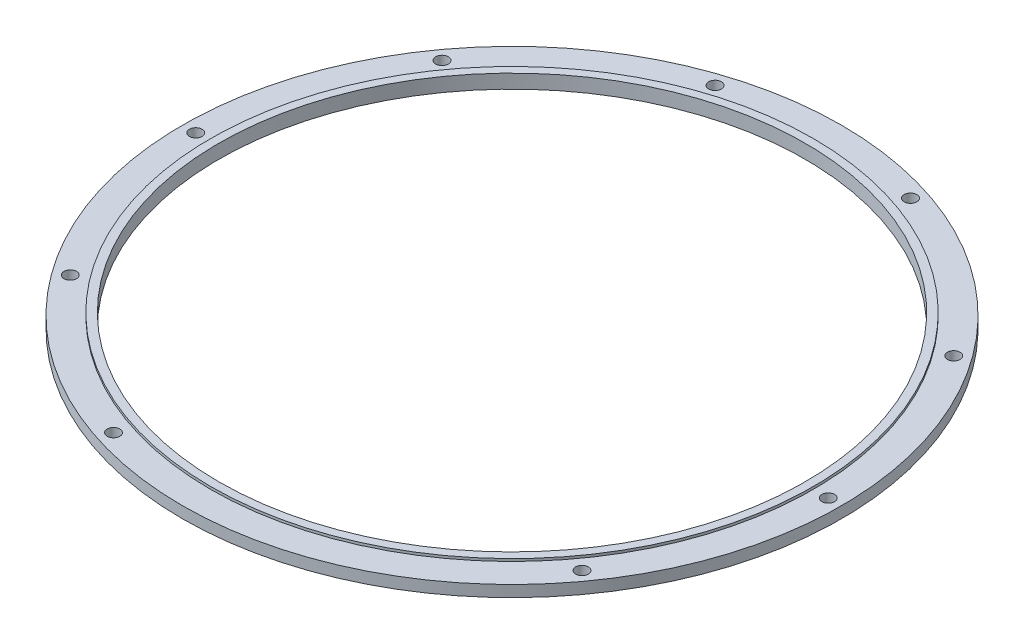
ISO-10303-21;
HEADER;
FILE_DESCRIPTION(('STEP AP214'),'2;1');
FILE_NAME('part.step','',(''),(''),'','','');
FILE_SCHEMA(('AUTOMOTIVE_DESIGN { 1 0 10303 214 1 1 1 1 }'));
ENDSEC;
DATA;
#1=APPLICATION_CONTEXT('core data for automotive mechanical design processes');
#2=APPLICATION_PROTOCOL_DEFINITION('international standard','automotive_design',2000,#1);
#3=PRODUCT_CONTEXT('',#1,'mechanical');
#4=PRODUCT('Part','Part','',(#3));
#5=PRODUCT_RELATED_PRODUCT_CATEGORY('part','',(#4));
#6=PRODUCT_DEFINITION_FORMATION('','',#4);
#7=PRODUCT_DEFINITION_CONTEXT('part definition',#1,'design');
#8=PRODUCT_DEFINITION('design','',#6,#7);
#9=PRODUCT_DEFINITION_SHAPE('','',#8);
#10=(LENGTH_UNIT() NAMED_UNIT(*) SI_UNIT(.MILLI.,.METRE.));
#11=(NAMED_UNIT(*) PLANE_ANGLE_UNIT() SI_UNIT($,.RADIAN.));
#12=(NAMED_UNIT(*) SI_UNIT($,.STERADIAN.) SOLID_ANGLE_UNIT());
#13=UNCERTAINTY_MEASURE_WITH_UNIT(LENGTH_MEASURE(1.E-05),#10,'distance_accuracy_value','');
#14=(GEOMETRIC_REPRESENTATION_CONTEXT(3) GLOBAL_UNCERTAINTY_ASSIGNED_CONTEXT((#13)) GLOBAL_UNIT_ASSIGNED_CONTEXT((#10,
#11,#12)) REPRESENTATION_CONTEXT('',''));
#15=CARTESIAN_POINT('',(0.,0.,0.));
#16=DIRECTION('',(0.,0.,1.));
#17=DIRECTION('',(1.,0.,0.));
#18=AXIS2_PLACEMENT_3D('',#15,#16,#17);
#19=CARTESIAN_POINT('',(0.,0.,0.));
#20=DIRECTION('',(0.,1.,0.));
#21=DIRECTION('',(0.,0.,1.));
#22=AXIS2_PLACEMENT_3D('',#19,#20,#21);
#23=CYLINDRICAL_SURFACE('',#22,84.858);
#24=CARTESIAN_POINT('',(-1.52655665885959E-13,-19.700999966,0.));
#25=DIRECTION('',(0.,1.,0.));
#26=DIRECTION('',(0.,0.,1.));
#27=AXIS2_PLACEMENT_3D('',#24,#25,#26);
#28=CIRCLE('',#27,84.858);
#29=CARTESIAN_POINT('',(-1.52655665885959E-13,-19.700999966,84.858));
#30=VERTEX_POINT('',#29);
#31=EDGE_CURVE('E10',#30,#30,#28,.T.);
#32=ORIENTED_EDGE('',*,*,#31,.T.);
#33=EDGE_LOOP('',(#32));
#34=FACE_BOUND('',#33,.T.);
#35=CARTESIAN_POINT('',(0.,-16.771999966,0.));
#36=DIRECTION('',(0.,1.,0.));
#37=DIRECTION('',(0.,0.,1.));
#38=AXIS2_PLACEMENT_3D('',#35,#36,#37);
#39=CIRCLE('',#38,84.858);
#40=CARTESIAN_POINT('',(0.,-16.771999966,84.858));
#41=VERTEX_POINT('',#40);
#42=EDGE_CURVE('E74',#41,#41,#39,.T.);
#43=ORIENTED_EDGE('',*,*,#42,.F.);
#44=EDGE_LOOP('',(#43));
#45=FACE_BOUND('',#44,.T.);
#46=ADVANCED_FACE('F34',(#34,#45),#23,.T.);
#47=CARTESIAN_POINT('',(-25.1629448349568,-19.7009999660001,-77.4435810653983));
#48=DIRECTION('',(0.,-1.,0.));
#49=DIRECTION('',(0.,0.,-1.));
#50=AXIS2_PLACEMENT_3D('',#47,#48,#49);
#51=CYLINDRICAL_SURFACE('',#50,1.63195);
#52=CARTESIAN_POINT('',(-25.1629448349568,-19.7009999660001,-77.4435810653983));
#53=DIRECTION('',(0.,-1.,0.));
#54=DIRECTION('',(0.,0.,-1.));
#55=AXIS2_PLACEMENT_3D('',#52,#53,#54);
#56=CIRCLE('',#55,1.63195);
#57=CARTESIAN_POINT('',(-25.1629448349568,-19.7009999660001,-79.0755310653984));
#58=VERTEX_POINT('',#57);
#59=EDGE_CURVE('E45',#58,#58,#56,.T.);
#60=ORIENTED_EDGE('',*,*,#59,.T.);
#61=EDGE_LOOP('',(#60));
#62=FACE_BOUND('',#61,.T.);
#63=CARTESIAN_POINT('',(-25.1629448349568,-16.7719999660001,-77.4435810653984));
#64=DIRECTION('',(0.,1.,0.));
#65=DIRECTION('',(0.,0.,1.));
#66=AXIS2_PLACEMENT_3D('',#63,#64,#65);
#67=CIRCLE('',#66,1.63195);
#68=CARTESIAN_POINT('',(-25.1629448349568,-16.7719999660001,-75.8116310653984));
#69=VERTEX_POINT('',#68);
#70=EDGE_CURVE('E77',#69,#69,#67,.F.);
#71=ORIENTED_EDGE('',*,*,#70,.F.);
#72=EDGE_LOOP('',(#71));
#73=FACE_BOUND('',#72,.T.);
#74=ADVANCED_FACE('F126',(#62,#73),#51,.F.);
#75=CARTESIAN_POINT('',(25.1629448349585,-19.7009999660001,-77.4435810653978));
#76=DIRECTION('',(0.,-1.,0.));
#77=DIRECTION('',(0.,0.,-1.));
#78=AXIS2_PLACEMENT_3D('',#75,#76,#77);
#79=CYLINDRICAL_SURFACE('',#78,1.63195);
#80=CARTESIAN_POINT('',(25.1629448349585,-19.7009999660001,-77.4435810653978));
#81=DIRECTION('',(0.,-1.,0.));
#82=DIRECTION('',(0.,0.,-1.));
#83=AXIS2_PLACEMENT_3D('',#80,#81,#82);
#84=CIRCLE('',#83,1.63195);
#85=CARTESIAN_POINT('',(25.1629448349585,-19.7009999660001,-79.0755310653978));
#86=VERTEX_POINT('',#85);
#87=EDGE_CURVE('E50',#86,#86,#84,.T.);
#88=ORIENTED_EDGE('',*,*,#87,.T.);
#89=EDGE_LOOP('',(#88));
#90=FACE_BOUND('',#89,.T.);
#91=CARTESIAN_POINT('',(25.1629448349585,-16.7719999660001,-77.4435810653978));
#92=DIRECTION('',(0.,1.,0.));
#93=DIRECTION('',(0.,0.,1.));
#94=AXIS2_PLACEMENT_3D('',#91,#92,#93);
#95=CIRCLE('',#94,1.63195);
#96=CARTESIAN_POINT('',(25.1629448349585,-16.7719999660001,-75.8116310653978));
#97=VERTEX_POINT('',#96);
#98=EDGE_CURVE('E80',#97,#97,#95,.F.);
#99=ORIENTED_EDGE('',*,*,#98,.F.);
#100=EDGE_LOOP('',(#99));
#101=FACE_BOUND('',#100,.T.);
#102=ADVANCED_FACE('F130',(#90,#101),#79,.F.);
#103=CARTESIAN_POINT('',(65.8774448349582,-19.700999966,-47.862765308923));
#104=DIRECTION('',(0.,-1.,0.));
#105=DIRECTION('',(0.,0.,-1.));
#106=AXIS2_PLACEMENT_3D('',#103,#104,#105);
#107=CYLINDRICAL_SURFACE('',#106,1.63194999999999);
#108=CARTESIAN_POINT('',(65.8774448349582,-19.700999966,-47.862765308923));
#109=DIRECTION('',(0.,-1.,0.));
#110=DIRECTION('',(0.,0.,-1.));
#111=AXIS2_PLACEMENT_3D('',#108,#109,#110);
#112=CIRCLE('',#111,1.63194999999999);
#113=CARTESIAN_POINT('',(65.8774448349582,-19.700999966,-49.494715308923));
#114=VERTEX_POINT('',#113);
#115=EDGE_CURVE('E53',#114,#114,#112,.T.);
#116=ORIENTED_EDGE('',*,*,#115,.T.);
#117=EDGE_LOOP('',(#116));
#118=FACE_BOUND('',#117,.T.);
#119=CARTESIAN_POINT('',(65.8774448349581,-16.771999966,-47.862765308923));
#120=DIRECTION('',(0.,1.,0.));
#121=DIRECTION('',(0.,0.,1.));
#122=AXIS2_PLACEMENT_3D('',#119,#120,#121);
#123=CIRCLE('',#122,1.63194999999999);
#124=CARTESIAN_POINT('',(65.8774448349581,-16.771999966,-46.230815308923));
#125=VERTEX_POINT('',#124);
#126=EDGE_CURVE('E83',#125,#125,#123,.F.);
#127=ORIENTED_EDGE('',*,*,#126,.F.);
#128=EDGE_LOOP('',(#127));
#129=FACE_BOUND('',#128,.T.);
#130=ADVANCED_FACE('F169',(#118,#129),#107,.F.);
#131=CARTESIAN_POINT('',(81.429,-19.700999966,1.13797860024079E-12));
#132=DIRECTION('',(0.,-1.,0.));
#133=DIRECTION('',(0.,0.,-1.));
#134=AXIS2_PLACEMENT_3D('',#131,#132,#133);
#135=CYLINDRICAL_SURFACE('',#134,1.63194999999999);
#136=CARTESIAN_POINT('',(81.429,-19.700999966,1.13797860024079E-12));
#137=DIRECTION('',(0.,-1.,0.));
#138=DIRECTION('',(0.,0.,-1.));
#139=AXIS2_PLACEMENT_3D('',#136,#137,#138);
#140=CIRCLE('',#139,1.63194999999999);
#141=CARTESIAN_POINT('',(81.429,-19.700999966,-1.63194999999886));
#142=VERTEX_POINT('',#141);
#143=EDGE_CURVE('E56',#142,#142,#140,.T.);
#144=ORIENTED_EDGE('',*,*,#143,.T.);
#145=EDGE_LOOP('',(#144));
#146=FACE_BOUND('',#145,.T.);
#147=CARTESIAN_POINT('',(81.429,-16.771999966,1.13797860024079E-12));
#148=DIRECTION('',(0.,1.,0.));
#149=DIRECTION('',(0.,0.,1.));
#150=AXIS2_PLACEMENT_3D('',#147,#148,#149);
#151=CIRCLE('',#150,1.63194999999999);
#152=CARTESIAN_POINT('',(81.429,-16.771999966,1.63195000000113));
#153=VERTEX_POINT('',#152);
#154=EDGE_CURVE('E86',#153,#153,#151,.F.);
#155=ORIENTED_EDGE('',*,*,#154,.F.);
#156=EDGE_LOOP('',(#155));
#157=FACE_BOUND('',#156,.T.);
#158=ADVANCED_FACE('F165',(#146,#157),#135,.F.);
#159=CARTESIAN_POINT('',(65.8774448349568,-19.700999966,47.8627653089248));
#160=DIRECTION('',(0.,-1.,0.));
#161=DIRECTION('',(0.,0.,-1.));
#162=AXIS2_PLACEMENT_3D('',#159,#160,#161);
#163=CYLINDRICAL_SURFACE('',#162,1.63194999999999);
#164=CARTESIAN_POINT('',(65.8774448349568,-19.700999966,47.8627653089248));
#165=DIRECTION('',(0.,-1.,0.));
#166=DIRECTION('',(0.,0.,-1.));
#167=AXIS2_PLACEMENT_3D('',#164,#165,#166);
#168=CIRCLE('',#167,1.63194999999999);
#169=CARTESIAN_POINT('',(65.8774448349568,-19.700999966,46.2308153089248));
#170=VERTEX_POINT('',#169);
#171=EDGE_CURVE('E59',#170,#170,#168,.T.);
#172=ORIENTED_EDGE('',*,*,#171,.T.);
#173=EDGE_LOOP('',(#172));
#174=FACE_BOUND('',#173,.T.);
#175=CARTESIAN_POINT('',(65.8774448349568,-16.771999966,47.8627653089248));
#176=DIRECTION('',(0.,1.,0.));
#177=DIRECTION('',(0.,0.,1.));
#178=AXIS2_PLACEMENT_3D('',#175,#176,#177);
#179=CIRCLE('',#178,1.63194999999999);
#180=CARTESIAN_POINT('',(65.8774448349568,-16.771999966,49.4947153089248));
#181=VERTEX_POINT('',#180);
#182=EDGE_CURVE('E89',#181,#181,#179,.F.);
#183=ORIENTED_EDGE('',*,*,#182,.F.);
#184=EDGE_LOOP('',(#183));
#185=FACE_BOUND('',#184,.T.);
#186=ADVANCED_FACE('F161',(#174,#185),#163,.F.);
#187=CARTESIAN_POINT('',(-25.162944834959,-19.700999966,77.4435810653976));
#188=DIRECTION('',(0.,-1.,0.));
#189=DIRECTION('',(0.,0.,-1.));
#190=AXIS2_PLACEMENT_3D('',#187,#188,#189);
#191=CYLINDRICAL_SURFACE('',#190,1.63195);
#192=CARTESIAN_POINT('',(-25.162944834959,-19.700999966,77.4435810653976));
#193=DIRECTION('',(0.,-1.,0.));
#194=DIRECTION('',(0.,0.,-1.));
#195=AXIS2_PLACEMENT_3D('',#192,#193,#194);
#196=CIRCLE('',#195,1.63195);
#197=CARTESIAN_POINT('',(-25.162944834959,-19.700999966,75.8116310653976));
#198=VERTEX_POINT('',#197);
#199=EDGE_CURVE('E62',#198,#198,#196,.T.);
#200=ORIENTED_EDGE('',*,*,#199,.T.);
#201=EDGE_LOOP('',(#200));
#202=FACE_BOUND('',#201,.T.);
#203=CARTESIAN_POINT('',(-25.162944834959,-16.771999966,77.4435810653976));
#204=DIRECTION('',(0.,1.,0.));
#205=DIRECTION('',(0.,0.,1.));
#206=AXIS2_PLACEMENT_3D('',#203,#204,#205);
#207=CIRCLE('',#206,1.63195);
#208=CARTESIAN_POINT('',(-25.162944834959,-16.771999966,79.0755310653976));
#209=VERTEX_POINT('',#208);
#210=EDGE_CURVE('E92',#209,#209,#207,.F.);
#211=ORIENTED_EDGE('',*,*,#210,.F.);
#212=EDGE_LOOP('',(#211));
#213=FACE_BOUND('',#212,.T.);
#214=ADVANCED_FACE('F157',(#202,#213),#191,.F.);
#215=CARTESIAN_POINT('',(-65.8774448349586,-19.700999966,47.8627653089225));
#216=DIRECTION('',(0.,-1.,0.));
#217=DIRECTION('',(0.,0.,-1.));
#218=AXIS2_PLACEMENT_3D('',#215,#216,#217);
#219=CYLINDRICAL_SURFACE('',#218,1.63194999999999);
#220=CARTESIAN_POINT('',(-65.8774448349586,-19.700999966,47.8627653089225));
#221=DIRECTION('',(0.,-1.,0.));
#222=DIRECTION('',(0.,0.,-1.));
#223=AXIS2_PLACEMENT_3D('',#220,#221,#222);
#224=CIRCLE('',#223,1.63194999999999);
#225=CARTESIAN_POINT('',(-65.8774448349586,-19.700999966,46.2308153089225));
#226=VERTEX_POINT('',#225);
#227=EDGE_CURVE('E65',#226,#226,#224,.T.);
#228=ORIENTED_EDGE('',*,*,#227,.T.);
#229=EDGE_LOOP('',(#228));
#230=FACE_BOUND('',#229,.T.);
#231=CARTESIAN_POINT('',(-65.8774448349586,-16.771999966,47.8627653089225));
#232=DIRECTION('',(0.,1.,0.));
#233=DIRECTION('',(0.,0.,1.));
#234=AXIS2_PLACEMENT_3D('',#231,#232,#233);
#235=CIRCLE('',#234,1.63194999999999);
#236=CARTESIAN_POINT('',(-65.8774448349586,-16.771999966,49.4947153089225));
#237=VERTEX_POINT('',#236);
#238=EDGE_CURVE('E95',#237,#237,#235,.F.);
#239=ORIENTED_EDGE('',*,*,#238,.F.);
#240=EDGE_LOOP('',(#239));
#241=FACE_BOUND('',#240,.T.);
#242=ADVANCED_FACE('F153',(#230,#241),#219,.F.);
#243=CARTESIAN_POINT('',(-81.429,-19.700999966,-1.73472347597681E-12));
#244=DIRECTION('',(0.,-1.,0.));
#245=DIRECTION('',(0.,0.,-1.));
#246=AXIS2_PLACEMENT_3D('',#243,#244,#245);
#247=CYLINDRICAL_SURFACE('',#246,1.63194999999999);
#248=CARTESIAN_POINT('',(-81.429,-19.700999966,-1.73472347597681E-12));
#249=DIRECTION('',(0.,-1.,0.));
#250=DIRECTION('',(0.,0.,-1.));
#251=AXIS2_PLACEMENT_3D('',#248,#249,#250);
#252=CIRCLE('',#251,1.63194999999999);
#253=CARTESIAN_POINT('',(-81.429,-19.700999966,-1.63195000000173));
#254=VERTEX_POINT('',#253);
#255=EDGE_CURVE('E68',#254,#254,#252,.T.);
#256=ORIENTED_EDGE('',*,*,#255,.T.);
#257=EDGE_LOOP('',(#256));
#258=FACE_BOUND('',#257,.T.);
#259=CARTESIAN_POINT('',(-81.429,-16.771999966,-1.73472347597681E-12));
#260=DIRECTION('',(0.,1.,0.));
#261=DIRECTION('',(0.,0.,1.));
#262=AXIS2_PLACEMENT_3D('',#259,#260,#261);
#263=CIRCLE('',#262,1.63194999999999);
#264=CARTESIAN_POINT('',(-81.429,-16.771999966,1.63194999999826));
#265=VERTEX_POINT('',#264);
#266=EDGE_CURVE('E98',#265,#265,#263,.F.);
#267=ORIENTED_EDGE('',*,*,#266,.F.);
#268=EDGE_LOOP('',(#267));
#269=FACE_BOUND('',#268,.T.);
#270=ADVANCED_FACE('F149',(#258,#269),#247,.F.);
#271=CARTESIAN_POINT('',(-65.8774448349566,-19.700999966,-47.8627653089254));
#272=DIRECTION('',(0.,-1.,0.));
#273=DIRECTION('',(0.,0.,-1.));
#274=AXIS2_PLACEMENT_3D('',#271,#272,#273);
#275=CYLINDRICAL_SURFACE('',#274,1.63194999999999);
#276=CARTESIAN_POINT('',(-65.8774448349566,-19.700999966,-47.8627653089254));
#277=DIRECTION('',(0.,-1.,0.));
#278=DIRECTION('',(0.,0.,-1.));
#279=AXIS2_PLACEMENT_3D('',#276,#277,#278);
#280=CIRCLE('',#279,1.63194999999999);
#281=CARTESIAN_POINT('',(-65.8774448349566,-19.700999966,-49.4947153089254));
#282=VERTEX_POINT('',#281);
#283=EDGE_CURVE('E71',#282,#282,#280,.T.);
#284=ORIENTED_EDGE('',*,*,#283,.T.);
#285=EDGE_LOOP('',(#284));
#286=FACE_BOUND('',#285,.T.);
#287=CARTESIAN_POINT('',(-65.8774448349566,-16.771999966,-47.8627653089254));
#288=DIRECTION('',(0.,1.,0.));
#289=DIRECTION('',(0.,0.,1.));
#290=AXIS2_PLACEMENT_3D('',#287,#288,#289);
#291=CIRCLE('',#290,1.63194999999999);
#292=CARTESIAN_POINT('',(-65.8774448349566,-16.771999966,-46.2308153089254));
#293=VERTEX_POINT('',#292);
#294=EDGE_CURVE('E37',#293,#293,#291,.F.);
#295=ORIENTED_EDGE('',*,*,#294,.F.);
#296=EDGE_LOOP('',(#295));
#297=FACE_BOUND('',#296,.T.);
#298=ADVANCED_FACE('F146',(#286,#297),#275,.F.);
#299=CARTESIAN_POINT('',(84.858,-19.700999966,0.));
#300=DIRECTION('',(0.,1.,0.));
#301=DIRECTION('',(0.,0.,1.));
#302=AXIS2_PLACEMENT_3D('',#299,#300,#301);
#303=PLANE('',#302);
#304=ORIENTED_EDGE('',*,*,#283,.F.);
#305=EDGE_LOOP('',(#304));
#306=FACE_BOUND('',#305,.T.);
#307=ORIENTED_EDGE('',*,*,#255,.F.);
#308=EDGE_LOOP('',(#307));
#309=FACE_BOUND('',#308,.T.);
#310=ORIENTED_EDGE('',*,*,#227,.F.);
#311=EDGE_LOOP('',(#310));
#312=FACE_BOUND('',#311,.T.);
#313=ORIENTED_EDGE('',*,*,#199,.F.);
#314=EDGE_LOOP('',(#313));
#315=FACE_BOUND('',#314,.T.);
#316=ORIENTED_EDGE('',*,*,#171,.F.);
#317=EDGE_LOOP('',(#316));
#318=FACE_BOUND('',#317,.T.);
#319=ORIENTED_EDGE('',*,*,#143,.F.);
#320=EDGE_LOOP('',(#319));
#321=FACE_BOUND('',#320,.T.);
#322=ORIENTED_EDGE('',*,*,#115,.F.);
#323=EDGE_LOOP('',(#322));
#324=FACE_BOUND('',#323,.T.);
#325=ORIENTED_EDGE('',*,*,#87,.F.);
#326=EDGE_LOOP('',(#325));
#327=FACE_BOUND('',#326,.T.);
#328=ORIENTED_EDGE('',*,*,#59,.F.);
#329=EDGE_LOOP('',(#328));
#330=FACE_BOUND('',#329,.T.);
#331=ORIENTED_EDGE('',*,*,#31,.F.);
#332=EDGE_LOOP('',(#331));
#333=FACE_BOUND('',#332,.T.);
#334=CARTESIAN_POINT('',(-1.52655665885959E-13,-19.700999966,0.));
#335=DIRECTION('',(0.,1.,0.));
#336=DIRECTION('',(0.,0.,1.));
#337=AXIS2_PLACEMENT_3D('',#334,#335,#336);
#338=CIRCLE('',#337,75.5);
#339=CARTESIAN_POINT('',(-1.52655665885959E-13,-19.700999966,75.5));
#340=VERTEX_POINT('',#339);
#341=EDGE_CURVE('E41',#340,#340,#338,.T.);
#342=ORIENTED_EDGE('',*,*,#341,.T.);
#343=EDGE_LOOP('',(#342));
#344=FACE_BOUND('',#343,.T.);
#345=ADVANCED_FACE('F141',(#306,#309,#312,#315,#318,#321,#324,#327,#330,#333,#344),#303,.F.);
#346=CARTESIAN_POINT('',(0.,0.,0.));
#347=DIRECTION('',(0.,1.,0.));
#348=DIRECTION('',(0.,0.,1.));
#349=AXIS2_PLACEMENT_3D('',#346,#347,#348);
#350=CYLINDRICAL_SURFACE('',#349,75.5);
#351=ORIENTED_EDGE('',*,*,#341,.F.);
#352=EDGE_LOOP('',(#351));
#353=FACE_BOUND('',#352,.T.);
#354=CARTESIAN_POINT('',(0.,-16.121999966,0.));
#355=DIRECTION('',(0.,1.,0.));
#356=DIRECTION('',(0.,0.,1.));
#357=AXIS2_PLACEMENT_3D('',#354,#355,#356);
#358=CIRCLE('',#357,75.5);
#359=CARTESIAN_POINT('',(0.,-16.121999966,75.5));
#360=VERTEX_POINT('',#359);
#361=EDGE_CURVE('E107',#360,#360,#358,.T.);
#362=ORIENTED_EDGE('',*,*,#361,.T.);
#363=EDGE_LOOP('',(#362));
#364=FACE_BOUND('',#363,.T.);
#365=ADVANCED_FACE('F111',(#353,#364),#350,.F.);
#366=CARTESIAN_POINT('',(77.6,-16.771999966,0.));
#367=DIRECTION('',(0.,1.,0.));
#368=DIRECTION('',(0.,0.,1.));
#369=AXIS2_PLACEMENT_3D('',#366,#367,#368);
#370=PLANE('',#369);
#371=ORIENTED_EDGE('',*,*,#70,.T.);
#372=EDGE_LOOP('',(#371));
#373=FACE_BOUND('',#372,.T.);
#374=ORIENTED_EDGE('',*,*,#126,.T.);
#375=EDGE_LOOP('',(#374));
#376=FACE_BOUND('',#375,.T.);
#377=ORIENTED_EDGE('',*,*,#182,.T.);
#378=EDGE_LOOP('',(#377));
#379=FACE_BOUND('',#378,.T.);
#380=ORIENTED_EDGE('',*,*,#238,.T.);
#381=EDGE_LOOP('',(#380));
#382=FACE_BOUND('',#381,.T.);
#383=ORIENTED_EDGE('',*,*,#294,.T.);
#384=EDGE_LOOP('',(#383));
#385=FACE_BOUND('',#384,.T.);
#386=CARTESIAN_POINT('',(0.,-16.771999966,0.));
#387=DIRECTION('',(0.,1.,0.));
#388=DIRECTION('',(0.,0.,1.));
#389=AXIS2_PLACEMENT_3D('',#386,#387,#388);
#390=CIRCLE('',#389,77.6);
#391=CARTESIAN_POINT('',(0.,-16.771999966,77.6));
#392=VERTEX_POINT('',#391);
#393=EDGE_CURVE('E101',#392,#392,#390,.T.);
#394=ORIENTED_EDGE('',*,*,#393,.F.);
#395=EDGE_LOOP('',(#394));
#396=FACE_BOUND('',#395,.T.);
#397=ORIENTED_EDGE('',*,*,#266,.T.);
#398=EDGE_LOOP('',(#397));
#399=FACE_BOUND('',#398,.T.);
#400=ORIENTED_EDGE('',*,*,#210,.T.);
#401=EDGE_LOOP('',(#400));
#402=FACE_BOUND('',#401,.T.);
#403=ORIENTED_EDGE('',*,*,#154,.T.);
#404=EDGE_LOOP('',(#403));
#405=FACE_BOUND('',#404,.T.);
#406=ORIENTED_EDGE('',*,*,#98,.T.);
#407=EDGE_LOOP('',(#406));
#408=FACE_BOUND('',#407,.T.);
#409=ORIENTED_EDGE('',*,*,#42,.T.);
#410=EDGE_LOOP('',(#409));
#411=FACE_BOUND('',#410,.T.);
#412=ADVANCED_FACE('F121',(#373,#376,#379,#382,#385,#396,#399,#402,#405,#408,#411),#370,.T.);
#413=CARTESIAN_POINT('',(0.,0.,0.));
#414=DIRECTION('',(0.,1.,0.));
#415=DIRECTION('',(0.,0.,1.));
#416=AXIS2_PLACEMENT_3D('',#413,#414,#415);
#417=CYLINDRICAL_SURFACE('',#416,77.6);
#418=ORIENTED_EDGE('',*,*,#393,.T.);
#419=EDGE_LOOP('',(#418));
#420=FACE_BOUND('',#419,.T.);
#421=CARTESIAN_POINT('',(0.,-16.121999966,0.));
#422=DIRECTION('',(0.,1.,0.));
#423=DIRECTION('',(0.,0.,1.));
#424=AXIS2_PLACEMENT_3D('',#421,#422,#423);
#425=CIRCLE('',#424,77.6);
#426=CARTESIAN_POINT('',(0.,-16.121999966,77.6));
#427=VERTEX_POINT('',#426);
#428=EDGE_CURVE('E104',#427,#427,#425,.T.);
#429=ORIENTED_EDGE('',*,*,#428,.F.);
#430=EDGE_LOOP('',(#429));
#431=FACE_BOUND('',#430,.T.);
#432=ADVANCED_FACE('F115',(#420,#431),#417,.T.);
#433=CARTESIAN_POINT('',(0.,-16.121999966,0.));
#434=DIRECTION('',(0.,1.,0.));
#435=DIRECTION('',(0.,0.,1.));
#436=AXIS2_PLACEMENT_3D('',#433,#434,#435);
#437=PLANE('',#436);
#438=ORIENTED_EDGE('',*,*,#428,.T.);
#439=EDGE_LOOP('',(#438));
#440=FACE_BOUND('',#439,.T.);
#441=ORIENTED_EDGE('',*,*,#361,.F.);
#442=EDGE_LOOP('',(#441));
#443=FACE_BOUND('',#442,.T.);
#444=ADVANCED_FACE('F113',(#440,#443),#437,.T.);
#445=CLOSED_SHELL('',(#46,#74,#102,#130,#158,#186,#214,#242,#270,#298,#345,#365,#412,#432,#444));
#446=MANIFOLD_SOLID_BREP('B2',#445);
#447=ADVANCED_BREP_SHAPE_REPRESENTATION('',(#18,#446),#14);
#448=SHAPE_DEFINITION_REPRESENTATION(#9,#447);
ENDSEC;
END-ISO-10303-21;
